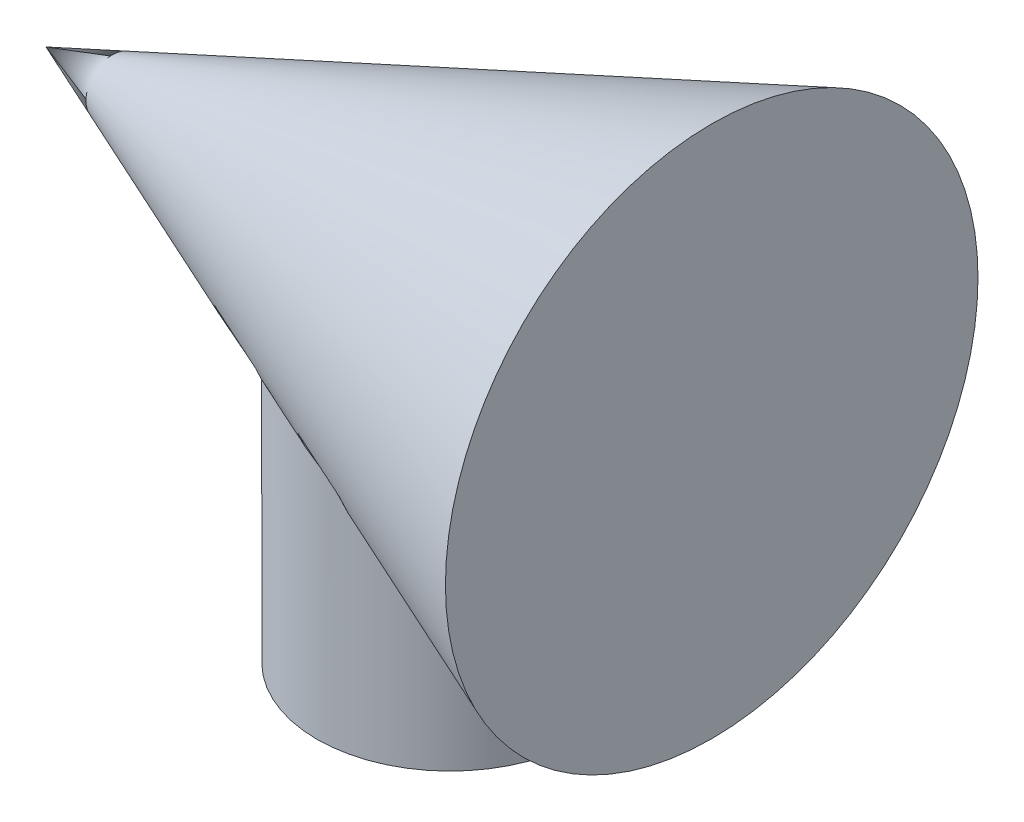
from build123d import *


with BuildPart() as part:
    # Sketch 1 → Revolve 1 (revolve)
    with BuildSketch(Plane.XY, mode=Mode.PRIVATE) as revolve_1_sk:
        Polygon((-56.216176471, 0), (-6.216176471, 20), (-6.216176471, 0), align=None)
    revolve(revolve_1_sk.sketch.rotate(Axis((-68.169117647, 0, 0), (1, 0, 0)), 270), axis=Axis((-68.169117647, 0, 0), (1, 0, 0)))

    # Sketch 2 → Revolve 2 (revolve)
    with BuildSketch(Plane.XY, mode=Mode.PRIVATE) as revolve_2_sk:
        Polygon((-35.870529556, 2.094073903), (-35.870529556, -24.861946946), (-25.870529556, -24.861946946), (-25.870529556, 3.672400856), align=None)
    revolve(revolve_2_sk.sketch.rotate(Axis((-25.870529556, 1.185149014, 0), (0, -1, 0)), 270), axis=Axis((-25.870529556, 1.185149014, 0), (0, -1, 0)))


solid = part.part
